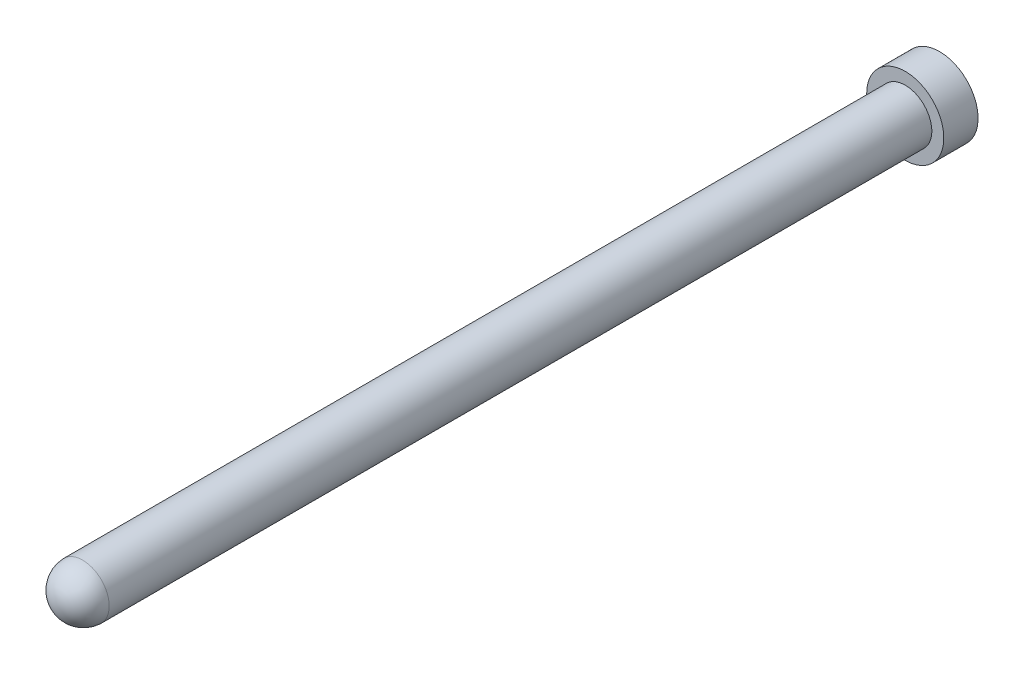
from build123d import *

# Parameters (mm, degrees)
ESQUISSE1_R          = 3.1
BASE_EXTRUSION_DEPTH = 100
ESQUISSE2_R          = 4.5
BOSS_EXTRU_1_DEPTH   = 4
D_ME1_FACE_RADIUS    = 3.1
D_ME1_HEIGHT         = 3


with BuildPart() as part:
    # Esquisse1 → Base-Extrusion (new body)
    with BuildSketch(Plane.XY):
        Circle(ESQUISSE1_R)
    extrude(amount=BASE_EXTRUSION_DEPTH)

    # Esquisse2 → Boss.-Extru.1 (add)
    with BuildSketch(Plane(origin=(0, 0, 0), x_dir=(-1, 0, 0), z_dir=(0, 0, -1))):
        Circle(ESQUISSE2_R)
    extrude(amount=-BOSS_EXTRU_1_DEPTH)

    # D_me1: a dome of height H over a round flat face of radius A is a cap of a sphere of radius (A * A + H * H) / (2 * H)
    d_me1_r = (D_ME1_FACE_RADIUS * D_ME1_FACE_RADIUS + D_ME1_HEIGHT * D_ME1_HEIGHT) / (2 * D_ME1_HEIGHT)
    d_me1_base = Plane((0, 0, 100), z_dir=(0, 0, 1))
    with Locations(d_me1_base.offset(D_ME1_HEIGHT - d_me1_r)):
        d_me1_ball = Sphere(d_me1_r, mode=Mode.PRIVATE)
    add(split(d_me1_ball, bisect_by=d_me1_base, keep=Keep.TOP, mode=Mode.PRIVATE))


solid = part.part
